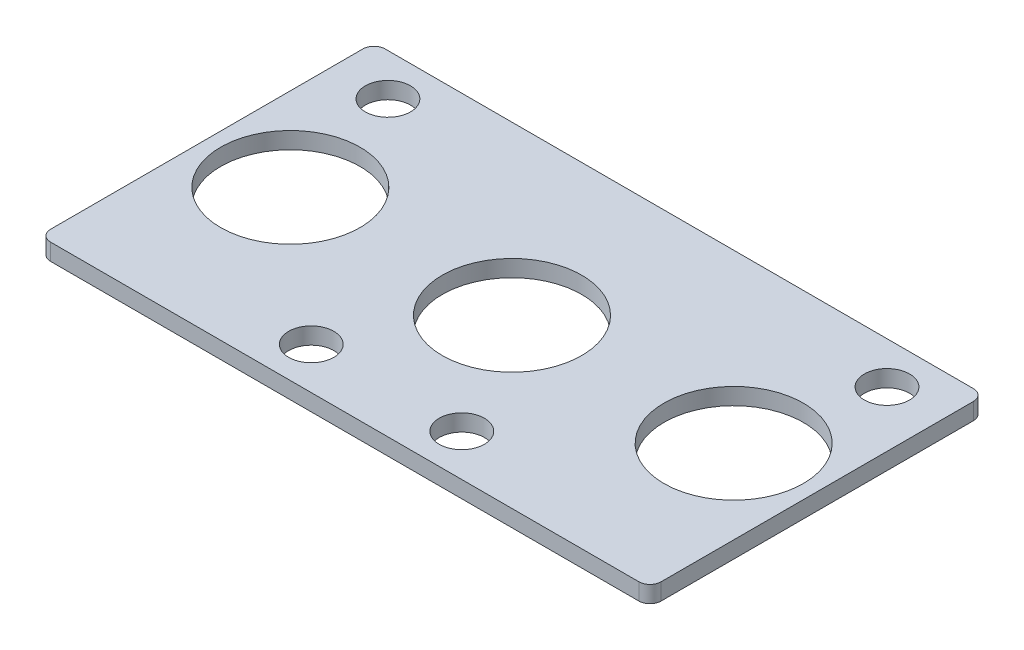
ISO-10303-21;
HEADER;
FILE_DESCRIPTION(('STEP AP214'),'2;1');
FILE_NAME('part.step','',(''),(''),'','','');
FILE_SCHEMA(('AUTOMOTIVE_DESIGN { 1 0 10303 214 1 1 1 1 }'));
ENDSEC;
DATA;
#1=APPLICATION_CONTEXT('core data for automotive mechanical design processes');
#2=APPLICATION_PROTOCOL_DEFINITION('international standard','automotive_design',2000,#1);
#3=PRODUCT_CONTEXT('',#1,'mechanical');
#4=PRODUCT('Part','Part','',(#3));
#5=PRODUCT_RELATED_PRODUCT_CATEGORY('part','',(#4));
#6=PRODUCT_DEFINITION_FORMATION('','',#4);
#7=PRODUCT_DEFINITION_CONTEXT('part definition',#1,'design');
#8=PRODUCT_DEFINITION('design','',#6,#7);
#9=PRODUCT_DEFINITION_SHAPE('','',#8);
#10=(LENGTH_UNIT() NAMED_UNIT(*) SI_UNIT(.MILLI.,.METRE.));
#11=(NAMED_UNIT(*) PLANE_ANGLE_UNIT() SI_UNIT($,.RADIAN.));
#12=(NAMED_UNIT(*) SI_UNIT($,.STERADIAN.) SOLID_ANGLE_UNIT());
#13=UNCERTAINTY_MEASURE_WITH_UNIT(LENGTH_MEASURE(1.E-05),#10,'distance_accuracy_value','');
#14=(GEOMETRIC_REPRESENTATION_CONTEXT(3) GLOBAL_UNCERTAINTY_ASSIGNED_CONTEXT((#13)) GLOBAL_UNIT_ASSIGNED_CONTEXT((#10,
#11,#12)) REPRESENTATION_CONTEXT('',''));
#15=CARTESIAN_POINT('',(0.,0.,0.));
#16=DIRECTION('',(0.,0.,1.));
#17=DIRECTION('',(1.,0.,0.));
#18=AXIS2_PLACEMENT_3D('',#15,#16,#17);
#19=CARTESIAN_POINT('',(3102.36975431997,3.,-1959.35266953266));
#20=DIRECTION('',(0.,1.,0.));
#21=DIRECTION('',(0.,0.,1.));
#22=AXIS2_PLACEMENT_3D('',#19,#20,#21);
#23=PLANE('',#22);
#24=CARTESIAN_POINT('',(3009.87101060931,3.,-1987.35266953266));
#25=DIRECTION('',(0.,1.,0.));
#26=DIRECTION('',(0.,0.,1.));
#27=AXIS2_PLACEMENT_3D('',#24,#25,#26);
#28=CIRCLE('',#27,12.5000000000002);
#29=CARTESIAN_POINT('',(3009.87101060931,3.,-1974.85266953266));
#30=VERTEX_POINT('',#29);
#31=EDGE_CURVE('E205',#30,#30,#28,.T.);
#32=ORIENTED_EDGE('',*,*,#31,.F.);
#33=EDGE_LOOP('',(#32));
#34=FACE_BOUND('',#33,.T.);
#35=CARTESIAN_POINT('',(3094.36975431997,3.,-2009.85266953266));
#36=DIRECTION('',(0.,1.,0.));
#37=DIRECTION('',(0.,0.,1.));
#38=AXIS2_PLACEMENT_3D('',#35,#36,#37);
#39=CIRCLE('',#38,4.04999999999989);
#40=CARTESIAN_POINT('',(3094.36975431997,3.,-2005.80266953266));
#41=VERTEX_POINT('',#40);
#42=EDGE_CURVE('E193',#41,#41,#39,.T.);
#43=ORIENTED_EDGE('',*,*,#42,.F.);
#44=EDGE_LOOP('',(#43));
#45=FACE_BOUND('',#44,.T.);
#46=CARTESIAN_POINT('',(3063.12038246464,3.,-1964.85266953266));
#47=DIRECTION('',(0.,1.,0.));
#48=DIRECTION('',(0.,0.,1.));
#49=AXIS2_PLACEMENT_3D('',#46,#47,#48);
#50=CIRCLE('',#49,4.04999999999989);
#51=CARTESIAN_POINT('',(3063.12038246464,3.,-1960.80266953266));
#52=VERTEX_POINT('',#51);
#53=EDGE_CURVE('E181',#52,#52,#50,.T.);
#54=ORIENTED_EDGE('',*,*,#53,.F.);
#55=EDGE_LOOP('',(#54));
#56=FACE_BOUND('',#55,.T.);
#57=CARTESIAN_POINT('',(3102.36975431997,3.,-1959.35266953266));
#58=DIRECTION('',(0.,1.,0.));
#59=DIRECTION('',(0.,0.,1.));
#60=AXIS2_PLACEMENT_3D('',#57,#58,#59);
#61=CIRCLE('',#60,2.);
#62=CARTESIAN_POINT('',(3102.36975431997,3.,-1957.35266953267));
#63=VERTEX_POINT('',#62);
#64=CARTESIAN_POINT('',(3104.36975431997,3.,-1959.35266953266));
#65=VERTEX_POINT('',#64);
#66=EDGE_CURVE('E144',#63,#65,#61,.T.);
#67=ORIENTED_EDGE('',*,*,#66,.T.);
#68=DIRECTION('',(0.,0.,-1.));
#69=VECTOR('',#68,1.);
#70=CARTESIAN_POINT('',(3104.36975431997,3.,-2015.35266953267));
#71=LINE('',#70,#69);
#72=CARTESIAN_POINT('',(3104.36975431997,3.,-2015.35266953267));
#73=VERTEX_POINT('',#72);
#74=EDGE_CURVE('E92',#65,#73,#71,.T.);
#75=ORIENTED_EDGE('',*,*,#74,.T.);
#76=CARTESIAN_POINT('',(3102.36975431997,3.,-2015.35266953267));
#77=DIRECTION('',(0.,1.,0.));
#78=DIRECTION('',(0.,0.,1.));
#79=AXIS2_PLACEMENT_3D('',#76,#77,#78);
#80=CIRCLE('',#79,2.);
#81=CARTESIAN_POINT('',(3102.36975431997,3.,-2017.35266953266));
#82=VERTEX_POINT('',#81);
#83=EDGE_CURVE('E159',#73,#82,#80,.T.);
#84=ORIENTED_EDGE('',*,*,#83,.T.);
#85=DIRECTION('',(-1.,0.,0.));
#86=VECTOR('',#85,1.);
#87=CARTESIAN_POINT('',(3102.36975431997,3.,-2017.35266953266));
#88=LINE('',#87,#86);
#89=CARTESIAN_POINT('',(2996.87101060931,3.,-2017.35266953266));
#90=VERTEX_POINT('',#89);
#91=EDGE_CURVE('E172',#82,#90,#88,.T.);
#92=ORIENTED_EDGE('',*,*,#91,.T.);
#93=CARTESIAN_POINT('',(2996.87101060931,3.,-2015.35266953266));
#94=DIRECTION('',(0.,1.,0.));
#95=DIRECTION('',(0.,0.,1.));
#96=AXIS2_PLACEMENT_3D('',#93,#94,#95);
#97=CIRCLE('',#96,2.00000000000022);
#98=CARTESIAN_POINT('',(2994.87101060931,3.,-2015.35266953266));
#99=VERTEX_POINT('',#98);
#100=EDGE_CURVE('E111',#90,#99,#97,.T.);
#101=ORIENTED_EDGE('',*,*,#100,.T.);
#102=DIRECTION('',(0.,0.,1.));
#103=VECTOR('',#102,1.);
#104=CARTESIAN_POINT('',(2994.87101060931,3.,-2015.35266953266));
#105=LINE('',#104,#103);
#106=CARTESIAN_POINT('',(2994.87101060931,3.,-1959.35266953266));
#107=VERTEX_POINT('',#106);
#108=EDGE_CURVE('E105',#99,#107,#105,.T.);
#109=ORIENTED_EDGE('',*,*,#108,.T.);
#110=CARTESIAN_POINT('',(2996.87101060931,3.,-1959.35266953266));
#111=DIRECTION('',(0.,1.,0.));
#112=DIRECTION('',(0.,0.,1.));
#113=AXIS2_PLACEMENT_3D('',#110,#111,#112);
#114=CIRCLE('',#113,2.00000000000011);
#115=CARTESIAN_POINT('',(2996.87101060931,3.,-1957.35266953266));
#116=VERTEX_POINT('',#115);
#117=EDGE_CURVE('E109',#107,#116,#114,.T.);
#118=ORIENTED_EDGE('',*,*,#117,.T.);
#119=DIRECTION('',(1.,0.,0.));
#120=VECTOR('',#119,1.);
#121=CARTESIAN_POINT('',(3102.36975431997,3.,-1957.35266953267));
#122=LINE('',#121,#120);
#123=EDGE_CURVE('E49',#116,#63,#122,.T.);
#124=ORIENTED_EDGE('',*,*,#123,.T.);
#125=EDGE_LOOP('',(#67,#75,#84,#92,#101,#109,#118,#124));
#126=FACE_BOUND('',#125,.T.);
#127=CARTESIAN_POINT('',(3036.12038246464,3.,-1964.85266953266));
#128=DIRECTION('',(0.,1.,0.));
#129=DIRECTION('',(0.,0.,1.));
#130=AXIS2_PLACEMENT_3D('',#127,#128,#129);
#131=CIRCLE('',#130,4.04999999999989);
#132=CARTESIAN_POINT('',(3036.12038246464,3.,-1960.80266953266));
#133=VERTEX_POINT('',#132);
#134=EDGE_CURVE('E133',#133,#133,#131,.T.);
#135=ORIENTED_EDGE('',*,*,#134,.F.);
#136=EDGE_LOOP('',(#135));
#137=FACE_BOUND('',#136,.T.);
#138=CARTESIAN_POINT('',(3004.87101060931,3.,-2009.85266953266));
#139=DIRECTION('',(0.,1.,0.));
#140=DIRECTION('',(0.,0.,1.));
#141=AXIS2_PLACEMENT_3D('',#138,#139,#140);
#142=CIRCLE('',#141,4.04999999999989);
#143=CARTESIAN_POINT('',(3004.87101060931,3.,-2005.80266953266));
#144=VERTEX_POINT('',#143);
#145=EDGE_CURVE('E187',#144,#144,#142,.T.);
#146=ORIENTED_EDGE('',*,*,#145,.F.);
#147=EDGE_LOOP('',(#146));
#148=FACE_BOUND('',#147,.T.);
#149=CARTESIAN_POINT('',(3049.62038246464,3.,-1987.35266953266));
#150=DIRECTION('',(0.,1.,0.));
#151=DIRECTION('',(0.,0.,1.));
#152=AXIS2_PLACEMENT_3D('',#149,#150,#151);
#153=CIRCLE('',#152,12.5000000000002);
#154=CARTESIAN_POINT('',(3049.62038246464,3.,-1974.85266953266));
#155=VERTEX_POINT('',#154);
#156=EDGE_CURVE('E199',#155,#155,#153,.T.);
#157=ORIENTED_EDGE('',*,*,#156,.F.);
#158=EDGE_LOOP('',(#157));
#159=FACE_BOUND('',#158,.T.);
#160=CARTESIAN_POINT('',(3089.36975431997,3.,-1987.35266953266));
#161=DIRECTION('',(0.,1.,0.));
#162=DIRECTION('',(0.,0.,1.));
#163=AXIS2_PLACEMENT_3D('',#160,#161,#162);
#164=CIRCLE('',#163,12.5000000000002);
#165=CARTESIAN_POINT('',(3089.36975431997,3.,-1974.85266953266));
#166=VERTEX_POINT('',#165);
#167=EDGE_CURVE('E211',#166,#166,#164,.T.);
#168=ORIENTED_EDGE('',*,*,#167,.F.);
#169=EDGE_LOOP('',(#168));
#170=FACE_BOUND('',#169,.T.);
#171=ADVANCED_FACE('F32',(#34,#45,#56,#126,#137,#148,#159,#170),#23,.T.);
#172=CARTESIAN_POINT('',(3102.36975431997,0.,-1959.35266953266));
#173=DIRECTION('',(0.,1.,0.));
#174=DIRECTION('',(0.,0.,1.));
#175=AXIS2_PLACEMENT_3D('',#172,#173,#174);
#176=PLANE('',#175);
#177=CARTESIAN_POINT('',(3009.87101060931,0.,-1987.35266953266));
#178=DIRECTION('',(0.,1.,0.));
#179=DIRECTION('',(0.,0.,1.));
#180=AXIS2_PLACEMENT_3D('',#177,#178,#179);
#181=CIRCLE('',#180,12.5000000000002);
#182=CARTESIAN_POINT('',(3009.87101060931,0.,-1974.85266953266));
#183=VERTEX_POINT('',#182);
#184=EDGE_CURVE('E208',#183,#183,#181,.T.);
#185=ORIENTED_EDGE('',*,*,#184,.T.);
#186=EDGE_LOOP('',(#185));
#187=FACE_BOUND('',#186,.T.);
#188=CARTESIAN_POINT('',(3094.36975431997,0.,-2009.85266953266));
#189=DIRECTION('',(0.,1.,0.));
#190=DIRECTION('',(0.,0.,1.));
#191=AXIS2_PLACEMENT_3D('',#188,#189,#190);
#192=CIRCLE('',#191,4.04999999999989);
#193=CARTESIAN_POINT('',(3094.36975431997,0.,-2005.80266953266));
#194=VERTEX_POINT('',#193);
#195=EDGE_CURVE('E196',#194,#194,#192,.T.);
#196=ORIENTED_EDGE('',*,*,#195,.T.);
#197=EDGE_LOOP('',(#196));
#198=FACE_BOUND('',#197,.T.);
#199=CARTESIAN_POINT('',(3063.12038246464,0.,-1964.85266953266));
#200=DIRECTION('',(0.,1.,0.));
#201=DIRECTION('',(0.,0.,1.));
#202=AXIS2_PLACEMENT_3D('',#199,#200,#201);
#203=CIRCLE('',#202,4.04999999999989);
#204=CARTESIAN_POINT('',(3063.12038246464,0.,-1960.80266953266));
#205=VERTEX_POINT('',#204);
#206=EDGE_CURVE('E184',#205,#205,#203,.T.);
#207=ORIENTED_EDGE('',*,*,#206,.T.);
#208=EDGE_LOOP('',(#207));
#209=FACE_BOUND('',#208,.T.);
#210=CARTESIAN_POINT('',(3102.36975431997,0.,-1959.35266953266));
#211=DIRECTION('',(0.,1.,0.));
#212=DIRECTION('',(0.,0.,1.));
#213=AXIS2_PLACEMENT_3D('',#210,#211,#212);
#214=CIRCLE('',#213,2.);
#215=CARTESIAN_POINT('',(3102.36975431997,0.,-1957.35266953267));
#216=VERTEX_POINT('',#215);
#217=CARTESIAN_POINT('',(3104.36975431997,0.,-1959.35266953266));
#218=VERTEX_POINT('',#217);
#219=EDGE_CURVE('E129',#216,#218,#214,.T.);
#220=ORIENTED_EDGE('',*,*,#219,.F.);
#221=DIRECTION('',(1.,0.,0.));
#222=VECTOR('',#221,1.);
#223=CARTESIAN_POINT('',(3102.36975431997,0.,-1957.35266953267));
#224=LINE('',#223,#222);
#225=CARTESIAN_POINT('',(2996.87101060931,0.,-1957.35266953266));
#226=VERTEX_POINT('',#225);
#227=EDGE_CURVE('E84',#226,#216,#224,.T.);
#228=ORIENTED_EDGE('',*,*,#227,.F.);
#229=CARTESIAN_POINT('',(2996.87101060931,0.,-1959.35266953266));
#230=DIRECTION('',(0.,1.,0.));
#231=DIRECTION('',(0.,0.,1.));
#232=AXIS2_PLACEMENT_3D('',#229,#230,#231);
#233=CIRCLE('',#232,2.00000000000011);
#234=CARTESIAN_POINT('',(2994.87101060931,0.,-1959.35266953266));
#235=VERTEX_POINT('',#234);
#236=EDGE_CURVE('E78',#235,#226,#233,.T.);
#237=ORIENTED_EDGE('',*,*,#236,.F.);
#238=DIRECTION('',(0.,0.,1.));
#239=VECTOR('',#238,1.);
#240=CARTESIAN_POINT('',(2994.87101060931,0.,-2015.35266953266));
#241=LINE('',#240,#239);
#242=CARTESIAN_POINT('',(2994.87101060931,0.,-2015.35266953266));
#243=VERTEX_POINT('',#242);
#244=EDGE_CURVE('E119',#243,#235,#241,.T.);
#245=ORIENTED_EDGE('',*,*,#244,.F.);
#246=CARTESIAN_POINT('',(2996.87101060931,0.,-2015.35266953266));
#247=DIRECTION('',(0.,1.,0.));
#248=DIRECTION('',(0.,0.,1.));
#249=AXIS2_PLACEMENT_3D('',#246,#247,#248);
#250=CIRCLE('',#249,2.00000000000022);
#251=CARTESIAN_POINT('',(2996.87101060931,0.,-2017.35266953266));
#252=VERTEX_POINT('',#251);
#253=EDGE_CURVE('E139',#252,#243,#250,.T.);
#254=ORIENTED_EDGE('',*,*,#253,.F.);
#255=DIRECTION('',(-1.,0.,0.));
#256=VECTOR('',#255,1.);
#257=CARTESIAN_POINT('',(3102.36975431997,0.,-2017.35266953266));
#258=LINE('',#257,#256);
#259=CARTESIAN_POINT('',(3102.36975431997,0.,-2017.35266953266));
#260=VERTEX_POINT('',#259);
#261=EDGE_CURVE('E137',#260,#252,#258,.T.);
#262=ORIENTED_EDGE('',*,*,#261,.F.);
#263=CARTESIAN_POINT('',(3102.36975431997,0.,-2015.35266953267));
#264=DIRECTION('',(0.,1.,0.));
#265=DIRECTION('',(0.,0.,1.));
#266=AXIS2_PLACEMENT_3D('',#263,#264,#265);
#267=CIRCLE('',#266,2.);
#268=CARTESIAN_POINT('',(3104.36975431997,0.,-2015.35266953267));
#269=VERTEX_POINT('',#268);
#270=EDGE_CURVE('E135',#269,#260,#267,.T.);
#271=ORIENTED_EDGE('',*,*,#270,.F.);
#272=DIRECTION('',(0.,0.,-1.));
#273=VECTOR('',#272,1.);
#274=CARTESIAN_POINT('',(3104.36975431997,0.,-2015.35266953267));
#275=LINE('',#274,#273);
#276=EDGE_CURVE('E132',#218,#269,#275,.T.);
#277=ORIENTED_EDGE('',*,*,#276,.F.);
#278=EDGE_LOOP('',(#220,#228,#237,#245,#254,#262,#271,#277));
#279=FACE_BOUND('',#278,.T.);
#280=CARTESIAN_POINT('',(3036.12038246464,0.,-1964.85266953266));
#281=DIRECTION('',(0.,1.,0.));
#282=DIRECTION('',(0.,0.,1.));
#283=AXIS2_PLACEMENT_3D('',#280,#281,#282);
#284=CIRCLE('',#283,4.04999999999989);
#285=CARTESIAN_POINT('',(3036.12038246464,0.,-1960.80266953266));
#286=VERTEX_POINT('',#285);
#287=EDGE_CURVE('E178',#286,#286,#284,.T.);
#288=ORIENTED_EDGE('',*,*,#287,.T.);
#289=EDGE_LOOP('',(#288));
#290=FACE_BOUND('',#289,.T.);
#291=CARTESIAN_POINT('',(3004.87101060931,0.,-2009.85266953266));
#292=DIRECTION('',(0.,1.,0.));
#293=DIRECTION('',(0.,0.,1.));
#294=AXIS2_PLACEMENT_3D('',#291,#292,#293);
#295=CIRCLE('',#294,4.04999999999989);
#296=CARTESIAN_POINT('',(3004.87101060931,0.,-2005.80266953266));
#297=VERTEX_POINT('',#296);
#298=EDGE_CURVE('E190',#297,#297,#295,.T.);
#299=ORIENTED_EDGE('',*,*,#298,.T.);
#300=EDGE_LOOP('',(#299));
#301=FACE_BOUND('',#300,.T.);
#302=CARTESIAN_POINT('',(3049.62038246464,0.,-1987.35266953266));
#303=DIRECTION('',(0.,1.,0.));
#304=DIRECTION('',(0.,0.,1.));
#305=AXIS2_PLACEMENT_3D('',#302,#303,#304);
#306=CIRCLE('',#305,12.5000000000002);
#307=CARTESIAN_POINT('',(3049.62038246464,0.,-1974.85266953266));
#308=VERTEX_POINT('',#307);
#309=EDGE_CURVE('E202',#308,#308,#306,.T.);
#310=ORIENTED_EDGE('',*,*,#309,.T.);
#311=EDGE_LOOP('',(#310));
#312=FACE_BOUND('',#311,.T.);
#313=CARTESIAN_POINT('',(3089.36975431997,0.,-1987.35266953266));
#314=DIRECTION('',(0.,1.,0.));
#315=DIRECTION('',(0.,0.,1.));
#316=AXIS2_PLACEMENT_3D('',#313,#314,#315);
#317=CIRCLE('',#316,12.5000000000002);
#318=CARTESIAN_POINT('',(3089.36975431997,0.,-1974.85266953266));
#319=VERTEX_POINT('',#318);
#320=EDGE_CURVE('E214',#319,#319,#317,.T.);
#321=ORIENTED_EDGE('',*,*,#320,.T.);
#322=EDGE_LOOP('',(#321));
#323=FACE_BOUND('',#322,.T.);
#324=ADVANCED_FACE('F163',(#187,#198,#209,#279,#290,#301,#312,#323),#176,.F.);
#325=CARTESIAN_POINT('',(3102.36975431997,3.,-1959.35266953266));
#326=DIRECTION('',(0.,-1.,0.));
#327=DIRECTION('',(0.,0.,-1.));
#328=AXIS2_PLACEMENT_3D('',#325,#326,#327);
#329=CYLINDRICAL_SURFACE('',#328,2.);
#330=ORIENTED_EDGE('',*,*,#219,.T.);
#331=DIRECTION('',(0.,-1.,0.));
#332=VECTOR('',#331,1.);
#333=CARTESIAN_POINT('',(3104.36975431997,3.,-1959.35266953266));
#334=LINE('',#333,#332);
#335=EDGE_CURVE('E11',#65,#218,#334,.T.);
#336=ORIENTED_EDGE('',*,*,#335,.F.);
#337=ORIENTED_EDGE('',*,*,#66,.F.);
#338=DIRECTION('',(0.,-1.,0.));
#339=VECTOR('',#338,1.);
#340=CARTESIAN_POINT('',(3102.36975431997,3.,-1957.35266953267));
#341=LINE('',#340,#339);
#342=EDGE_CURVE('E125',#63,#216,#341,.T.);
#343=ORIENTED_EDGE('',*,*,#342,.T.);
#344=EDGE_LOOP('',(#330,#336,#337,#343));
#345=FACE_BOUND('',#344,.T.);
#346=ADVANCED_FACE('F34',(#345),#329,.T.);
#347=CARTESIAN_POINT('',(3104.36975431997,3.,-2015.35266953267));
#348=DIRECTION('',(-1.,0.,0.));
#349=DIRECTION('',(0.,0.,1.));
#350=AXIS2_PLACEMENT_3D('',#347,#348,#349);
#351=PLANE('',#350);
#352=ORIENTED_EDGE('',*,*,#276,.T.);
#353=DIRECTION('',(0.,-1.,0.));
#354=VECTOR('',#353,1.);
#355=CARTESIAN_POINT('',(3104.36975431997,3.,-2015.35266953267));
#356=LINE('',#355,#354);
#357=EDGE_CURVE('E41',#73,#269,#356,.T.);
#358=ORIENTED_EDGE('',*,*,#357,.F.);
#359=ORIENTED_EDGE('',*,*,#74,.F.);
#360=ORIENTED_EDGE('',*,*,#335,.T.);
#361=EDGE_LOOP('',(#352,#358,#359,#360));
#362=FACE_BOUND('',#361,.T.);
#363=ADVANCED_FACE('F249',(#362),#351,.F.);
#364=CARTESIAN_POINT('',(3102.36975431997,3.,-2015.35266953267));
#365=DIRECTION('',(0.,-1.,0.));
#366=DIRECTION('',(0.,0.,-1.));
#367=AXIS2_PLACEMENT_3D('',#364,#365,#366);
#368=CYLINDRICAL_SURFACE('',#367,2.);
#369=ORIENTED_EDGE('',*,*,#270,.T.);
#370=DIRECTION('',(0.,-1.,0.));
#371=VECTOR('',#370,1.);
#372=CARTESIAN_POINT('',(3102.36975431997,3.,-2017.35266953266));
#373=LINE('',#372,#371);
#374=EDGE_CURVE('E151',#82,#260,#373,.T.);
#375=ORIENTED_EDGE('',*,*,#374,.F.);
#376=ORIENTED_EDGE('',*,*,#83,.F.);
#377=ORIENTED_EDGE('',*,*,#357,.T.);
#378=EDGE_LOOP('',(#369,#375,#376,#377));
#379=FACE_BOUND('',#378,.T.);
#380=ADVANCED_FACE('F157',(#379),#368,.T.);
#381=CARTESIAN_POINT('',(3102.36975431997,3.,-2017.35266953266));
#382=DIRECTION('',(0.,0.,1.));
#383=DIRECTION('',(1.,0.,0.));
#384=AXIS2_PLACEMENT_3D('',#381,#382,#383);
#385=PLANE('',#384);
#386=ORIENTED_EDGE('',*,*,#261,.T.);
#387=DIRECTION('',(0.,-1.,0.));
#388=VECTOR('',#387,1.);
#389=CARTESIAN_POINT('',(2996.87101060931,3.,-2017.35266953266));
#390=LINE('',#389,#388);
#391=EDGE_CURVE('E148',#90,#252,#390,.T.);
#392=ORIENTED_EDGE('',*,*,#391,.F.);
#393=ORIENTED_EDGE('',*,*,#91,.F.);
#394=ORIENTED_EDGE('',*,*,#374,.T.);
#395=EDGE_LOOP('',(#386,#392,#393,#394));
#396=FACE_BOUND('',#395,.T.);
#397=ADVANCED_FACE('F168',(#396),#385,.F.);
#398=CARTESIAN_POINT('',(2996.87101060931,3.,-2015.35266953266));
#399=DIRECTION('',(0.,-1.,0.));
#400=DIRECTION('',(0.,0.,-1.));
#401=AXIS2_PLACEMENT_3D('',#398,#399,#400);
#402=CYLINDRICAL_SURFACE('',#401,2.00000000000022);
#403=ORIENTED_EDGE('',*,*,#253,.T.);
#404=DIRECTION('',(0.,-1.,0.));
#405=VECTOR('',#404,1.);
#406=CARTESIAN_POINT('',(2994.87101060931,3.,-2015.35266953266));
#407=LINE('',#406,#405);
#408=EDGE_CURVE('E120',#99,#243,#407,.T.);
#409=ORIENTED_EDGE('',*,*,#408,.F.);
#410=ORIENTED_EDGE('',*,*,#100,.F.);
#411=ORIENTED_EDGE('',*,*,#391,.T.);
#412=EDGE_LOOP('',(#403,#409,#410,#411));
#413=FACE_BOUND('',#412,.T.);
#414=ADVANCED_FACE('F171',(#413),#402,.T.);
#415=CARTESIAN_POINT('',(2994.87101060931,3.,-2015.35266953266));
#416=DIRECTION('',(1.,0.,0.));
#417=DIRECTION('',(0.,0.,-1.));
#418=AXIS2_PLACEMENT_3D('',#415,#416,#417);
#419=PLANE('',#418);
#420=ORIENTED_EDGE('',*,*,#244,.T.);
#421=DIRECTION('',(0.,-1.,0.));
#422=VECTOR('',#421,1.);
#423=CARTESIAN_POINT('',(2994.87101060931,3.,-1959.35266953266));
#424=LINE('',#423,#422);
#425=EDGE_CURVE('E116',#107,#235,#424,.T.);
#426=ORIENTED_EDGE('',*,*,#425,.F.);
#427=ORIENTED_EDGE('',*,*,#108,.F.);
#428=ORIENTED_EDGE('',*,*,#408,.T.);
#429=EDGE_LOOP('',(#420,#426,#427,#428));
#430=FACE_BOUND('',#429,.T.);
#431=ADVANCED_FACE('F117',(#430),#419,.F.);
#432=CARTESIAN_POINT('',(2996.87101060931,3.,-1959.35266953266));
#433=DIRECTION('',(0.,-1.,0.));
#434=DIRECTION('',(0.,0.,-1.));
#435=AXIS2_PLACEMENT_3D('',#432,#433,#434);
#436=CYLINDRICAL_SURFACE('',#435,2.00000000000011);
#437=ORIENTED_EDGE('',*,*,#236,.T.);
#438=DIRECTION('',(0.,-1.,0.));
#439=VECTOR('',#438,1.);
#440=CARTESIAN_POINT('',(2996.87101060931,3.,-1957.35266953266));
#441=LINE('',#440,#439);
#442=EDGE_CURVE('E121',#116,#226,#441,.T.);
#443=ORIENTED_EDGE('',*,*,#442,.F.);
#444=ORIENTED_EDGE('',*,*,#117,.F.);
#445=ORIENTED_EDGE('',*,*,#425,.T.);
#446=EDGE_LOOP('',(#437,#443,#444,#445));
#447=FACE_BOUND('',#446,.T.);
#448=ADVANCED_FACE('F123',(#447),#436,.T.);
#449=CARTESIAN_POINT('',(3102.36975431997,3.,-1957.35266953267));
#450=DIRECTION('',(0.,0.,-1.));
#451=DIRECTION('',(-1.,0.,0.));
#452=AXIS2_PLACEMENT_3D('',#449,#450,#451);
#453=PLANE('',#452);
#454=ORIENTED_EDGE('',*,*,#227,.T.);
#455=ORIENTED_EDGE('',*,*,#342,.F.);
#456=ORIENTED_EDGE('',*,*,#123,.F.);
#457=ORIENTED_EDGE('',*,*,#442,.T.);
#458=EDGE_LOOP('',(#454,#455,#456,#457));
#459=FACE_BOUND('',#458,.T.);
#460=ADVANCED_FACE('F237',(#459),#453,.F.);
#461=CARTESIAN_POINT('',(3036.12038246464,3.,-1964.85266953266));
#462=DIRECTION('',(0.,-1.,0.));
#463=DIRECTION('',(0.,0.,-1.));
#464=AXIS2_PLACEMENT_3D('',#461,#462,#463);
#465=CYLINDRICAL_SURFACE('',#464,4.04999999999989);
#466=ORIENTED_EDGE('',*,*,#134,.T.);
#467=EDGE_LOOP('',(#466));
#468=FACE_BOUND('',#467,.T.);
#469=ORIENTED_EDGE('',*,*,#287,.F.);
#470=EDGE_LOOP('',(#469));
#471=FACE_BOUND('',#470,.T.);
#472=ADVANCED_FACE('F234',(#468,#471),#465,.F.);
#473=CARTESIAN_POINT('',(3063.12038246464,3.,-1964.85266953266));
#474=DIRECTION('',(0.,-1.,0.));
#475=DIRECTION('',(0.,0.,-1.));
#476=AXIS2_PLACEMENT_3D('',#473,#474,#475);
#477=CYLINDRICAL_SURFACE('',#476,4.04999999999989);
#478=ORIENTED_EDGE('',*,*,#53,.T.);
#479=EDGE_LOOP('',(#478));
#480=FACE_BOUND('',#479,.T.);
#481=ORIENTED_EDGE('',*,*,#206,.F.);
#482=EDGE_LOOP('',(#481));
#483=FACE_BOUND('',#482,.T.);
#484=ADVANCED_FACE('F313',(#480,#483),#477,.F.);
#485=CARTESIAN_POINT('',(3004.87101060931,3.,-2009.85266953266));
#486=DIRECTION('',(0.,-1.,0.));
#487=DIRECTION('',(0.,0.,-1.));
#488=AXIS2_PLACEMENT_3D('',#485,#486,#487);
#489=CYLINDRICAL_SURFACE('',#488,4.04999999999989);
#490=ORIENTED_EDGE('',*,*,#145,.T.);
#491=EDGE_LOOP('',(#490));
#492=FACE_BOUND('',#491,.T.);
#493=ORIENTED_EDGE('',*,*,#298,.F.);
#494=EDGE_LOOP('',(#493));
#495=FACE_BOUND('',#494,.T.);
#496=ADVANCED_FACE('F321',(#492,#495),#489,.F.);
#497=CARTESIAN_POINT('',(3094.36975431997,3.,-2009.85266953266));
#498=DIRECTION('',(0.,-1.,0.));
#499=DIRECTION('',(0.,0.,-1.));
#500=AXIS2_PLACEMENT_3D('',#497,#498,#499);
#501=CYLINDRICAL_SURFACE('',#500,4.04999999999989);
#502=ORIENTED_EDGE('',*,*,#42,.T.);
#503=EDGE_LOOP('',(#502));
#504=FACE_BOUND('',#503,.T.);
#505=ORIENTED_EDGE('',*,*,#195,.F.);
#506=EDGE_LOOP('',(#505));
#507=FACE_BOUND('',#506,.T.);
#508=ADVANCED_FACE('F329',(#504,#507),#501,.F.);
#509=CARTESIAN_POINT('',(3049.62038246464,3.,-1987.35266953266));
#510=DIRECTION('',(0.,-1.,0.));
#511=DIRECTION('',(0.,0.,-1.));
#512=AXIS2_PLACEMENT_3D('',#509,#510,#511);
#513=CYLINDRICAL_SURFACE('',#512,12.5000000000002);
#514=ORIENTED_EDGE('',*,*,#156,.T.);
#515=EDGE_LOOP('',(#514));
#516=FACE_BOUND('',#515,.T.);
#517=ORIENTED_EDGE('',*,*,#309,.F.);
#518=EDGE_LOOP('',(#517));
#519=FACE_BOUND('',#518,.T.);
#520=ADVANCED_FACE('F338',(#516,#519),#513,.F.);
#521=CARTESIAN_POINT('',(3009.87101060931,3.,-1987.35266953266));
#522=DIRECTION('',(0.,-1.,0.));
#523=DIRECTION('',(0.,0.,-1.));
#524=AXIS2_PLACEMENT_3D('',#521,#522,#523);
#525=CYLINDRICAL_SURFACE('',#524,12.5000000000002);
#526=ORIENTED_EDGE('',*,*,#31,.T.);
#527=EDGE_LOOP('',(#526));
#528=FACE_BOUND('',#527,.T.);
#529=ORIENTED_EDGE('',*,*,#184,.F.);
#530=EDGE_LOOP('',(#529));
#531=FACE_BOUND('',#530,.T.);
#532=ADVANCED_FACE('F347',(#528,#531),#525,.F.);
#533=CARTESIAN_POINT('',(3089.36975431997,3.,-1987.35266953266));
#534=DIRECTION('',(0.,-1.,0.));
#535=DIRECTION('',(0.,0.,-1.));
#536=AXIS2_PLACEMENT_3D('',#533,#534,#535);
#537=CYLINDRICAL_SURFACE('',#536,12.5000000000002);
#538=ORIENTED_EDGE('',*,*,#167,.T.);
#539=EDGE_LOOP('',(#538));
#540=FACE_BOUND('',#539,.T.);
#541=ORIENTED_EDGE('',*,*,#320,.F.);
#542=EDGE_LOOP('',(#541));
#543=FACE_BOUND('',#542,.T.);
#544=ADVANCED_FACE('F220',(#540,#543),#537,.F.);
#545=CLOSED_SHELL('',(#171,#324,#346,#363,#380,#397,#414,#431,#448,#460,#472,#484,#496,#508,
#520,#532,#544));
#546=MANIFOLD_SOLID_BREP('B2',#545);
#547=ADVANCED_BREP_SHAPE_REPRESENTATION('',(#18,#546),#14);
#548=SHAPE_DEFINITION_REPRESENTATION(#9,#547);
ENDSEC;
END-ISO-10303-21;
